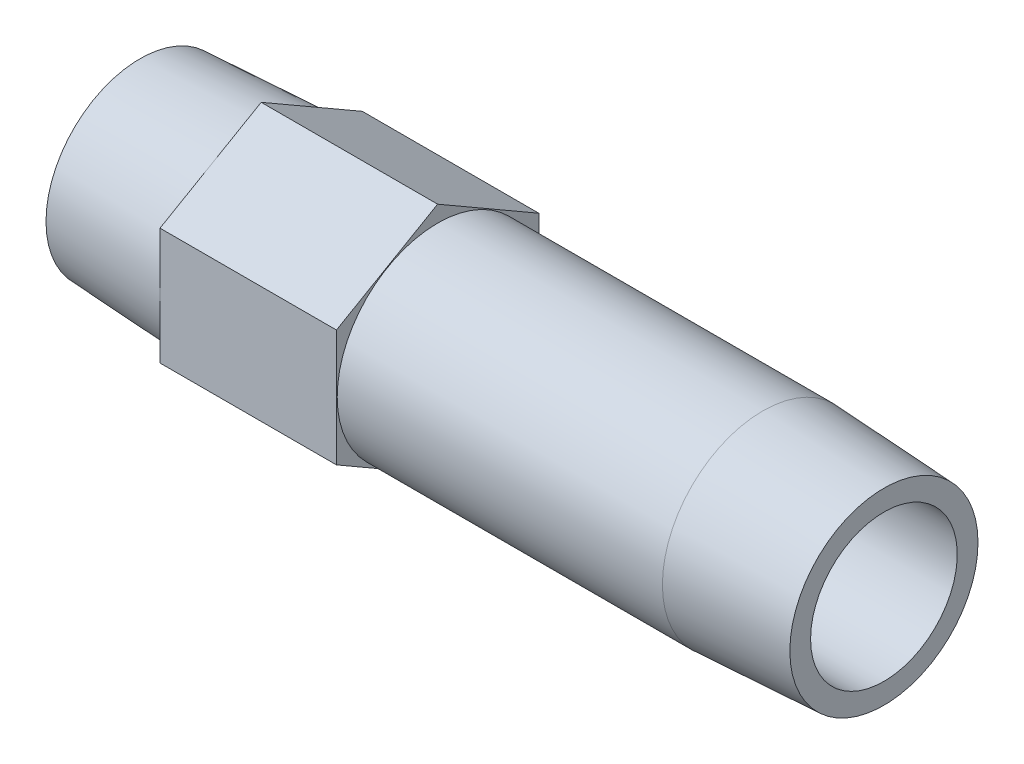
ISO-10303-21;
HEADER;
FILE_DESCRIPTION(('STEP AP214'),'2;1');
FILE_NAME('part.step','',(''),(''),'','','');
FILE_SCHEMA(('AUTOMOTIVE_DESIGN { 1 0 10303 214 1 1 1 1 }'));
ENDSEC;
DATA;
#1=APPLICATION_CONTEXT('core data for automotive mechanical design processes');
#2=APPLICATION_PROTOCOL_DEFINITION('international standard','automotive_design',2000,#1);
#3=PRODUCT_CONTEXT('',#1,'mechanical');
#4=PRODUCT('Part','Part','',(#3));
#5=PRODUCT_RELATED_PRODUCT_CATEGORY('part','',(#4));
#6=PRODUCT_DEFINITION_FORMATION('','',#4);
#7=PRODUCT_DEFINITION_CONTEXT('part definition',#1,'design');
#8=PRODUCT_DEFINITION('design','',#6,#7);
#9=PRODUCT_DEFINITION_SHAPE('','',#8);
#10=(LENGTH_UNIT() NAMED_UNIT(*) SI_UNIT(.MILLI.,.METRE.));
#11=(NAMED_UNIT(*) PLANE_ANGLE_UNIT() SI_UNIT($,.RADIAN.));
#12=(NAMED_UNIT(*) SI_UNIT($,.STERADIAN.) SOLID_ANGLE_UNIT());
#13=UNCERTAINTY_MEASURE_WITH_UNIT(LENGTH_MEASURE(1.E-05),#10,'distance_accuracy_value','');
#14=(GEOMETRIC_REPRESENTATION_CONTEXT(3) GLOBAL_UNCERTAINTY_ASSIGNED_CONTEXT((#13)) GLOBAL_UNIT_ASSIGNED_CONTEXT((#10,
#11,#12)) REPRESENTATION_CONTEXT('',''));
#15=CARTESIAN_POINT('',(0.,0.,0.));
#16=DIRECTION('',(0.,0.,1.));
#17=DIRECTION('',(1.,0.,0.));
#18=AXIS2_PLACEMENT_3D('',#15,#16,#17);
#19=CARTESIAN_POINT('',(0.,0.,-8.03071885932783));
#20=DIRECTION('',(1.,0.,0.));
#21=DIRECTION('',(0.,0.,-1.));
#22=AXIS2_PLACEMENT_3D('',#19,#20,#21);
#23=PLANE('',#22);
#24=CARTESIAN_POINT('',(0.,0.,0.));
#25=DIRECTION('',(-1.,0.,0.));
#26=DIRECTION('',(0.,0.,1.));
#27=AXIS2_PLACEMENT_3D('',#24,#25,#26);
#28=CIRCLE('',#27,8.03071885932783);
#29=CARTESIAN_POINT('',(0.,0.,8.03071885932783));
#30=VERTEX_POINT('',#29);
#31=EDGE_CURVE('E147',#30,#30,#28,.T.);
#32=ORIENTED_EDGE('',*,*,#31,.T.);
#33=EDGE_LOOP('',(#32));
#34=FACE_BOUND('',#33,.T.);
#35=CARTESIAN_POINT('',(0.,0.,0.));
#36=DIRECTION('',(1.,0.,0.));
#37=DIRECTION('',(0.,0.,1.));
#38=AXIS2_PLACEMENT_3D('',#35,#36,#37);
#39=CIRCLE('',#38,6.2611);
#40=CARTESIAN_POINT('',(0.,0.,6.2611));
#41=VERTEX_POINT('',#40);
#42=EDGE_CURVE('E159',#41,#41,#39,.T.);
#43=ORIENTED_EDGE('',*,*,#42,.T.);
#44=EDGE_LOOP('',(#43));
#45=FACE_BOUND('',#44,.T.);
#46=ADVANCED_FACE('F15',(#34,#45),#23,.F.);
#47=CARTESIAN_POINT('',(63.5,0.,-8.0307188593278));
#48=DIRECTION('',(-1.,0.,0.));
#49=DIRECTION('',(0.,0.,1.));
#50=AXIS2_PLACEMENT_3D('',#47,#48,#49);
#51=PLANE('',#50);
#52=CARTESIAN_POINT('',(63.5,0.,0.));
#53=DIRECTION('',(-1.,0.,0.));
#54=DIRECTION('',(0.,0.,1.));
#55=AXIS2_PLACEMENT_3D('',#52,#53,#54);
#56=CIRCLE('',#55,8.0307188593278);
#57=CARTESIAN_POINT('',(63.5,0.,8.0307188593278));
#58=VERTEX_POINT('',#57);
#59=EDGE_CURVE('E150',#58,#58,#56,.T.);
#60=ORIENTED_EDGE('',*,*,#59,.F.);
#61=EDGE_LOOP('',(#60));
#62=FACE_BOUND('',#61,.T.);
#63=CARTESIAN_POINT('',(63.5,0.,0.));
#64=DIRECTION('',(-1.,0.,0.));
#65=DIRECTION('',(0.,0.,1.));
#66=AXIS2_PLACEMENT_3D('',#63,#64,#65);
#67=CIRCLE('',#66,6.2611);
#68=CARTESIAN_POINT('',(63.5,0.,6.2611));
#69=VERTEX_POINT('',#68);
#70=EDGE_CURVE('E156',#69,#69,#67,.F.);
#71=ORIENTED_EDGE('',*,*,#70,.F.);
#72=EDGE_LOOP('',(#71));
#73=FACE_BOUND('',#72,.T.);
#74=ADVANCED_FACE('F178',(#62,#73),#51,.F.);
#75=CARTESIAN_POINT('',(25.4,-4.9859969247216,-8.636));
#76=DIRECTION('',(1.,0.,0.));
#77=DIRECTION('',(0.,1.,0.));
#78=AXIS2_PLACEMENT_3D('',#75,#76,#77);
#79=PLANE('',#78);
#80=DIRECTION('',(0.,0.5,-0.866025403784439));
#81=VECTOR('',#80,1.);
#82=CARTESIAN_POINT('',(25.4,-9.97199384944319,0.));
#83=LINE('',#82,#81);
#84=CARTESIAN_POINT('',(25.4,-9.97199384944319,0.));
#85=VERTEX_POINT('',#84);
#86=CARTESIAN_POINT('',(25.4,-4.9859969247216,-8.636));
#87=VERTEX_POINT('',#86);
#88=EDGE_CURVE('E103',#85,#87,#83,.T.);
#89=ORIENTED_EDGE('',*,*,#88,.T.);
#90=DIRECTION('',(0.,1.,0.));
#91=VECTOR('',#90,1.);
#92=CARTESIAN_POINT('',(25.4,-4.9859969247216,-8.636));
#93=LINE('',#92,#91);
#94=CARTESIAN_POINT('',(25.4,4.9859969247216,-8.636));
#95=VERTEX_POINT('',#94);
#96=EDGE_CURVE('E83',#87,#95,#93,.T.);
#97=ORIENTED_EDGE('',*,*,#96,.T.);
#98=DIRECTION('',(0.,0.5,0.866025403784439));
#99=VECTOR('',#98,1.);
#100=CARTESIAN_POINT('',(25.4,4.9859969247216,-8.636));
#101=LINE('',#100,#99);
#102=CARTESIAN_POINT('',(25.4,9.97199384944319,0.));
#103=VERTEX_POINT('',#102);
#104=EDGE_CURVE('E102',#95,#103,#101,.T.);
#105=ORIENTED_EDGE('',*,*,#104,.T.);
#106=DIRECTION('',(0.,-0.5,0.866025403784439));
#107=VECTOR('',#106,1.);
#108=CARTESIAN_POINT('',(25.4,9.97199384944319,0.));
#109=LINE('',#108,#107);
#110=CARTESIAN_POINT('',(25.4,4.9859969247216,8.636));
#111=VERTEX_POINT('',#110);
#112=EDGE_CURVE('E105',#103,#111,#109,.T.);
#113=ORIENTED_EDGE('',*,*,#112,.T.);
#114=DIRECTION('',(0.,-1.,0.));
#115=VECTOR('',#114,1.);
#116=CARTESIAN_POINT('',(25.4,4.9859969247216,8.636));
#117=LINE('',#116,#115);
#118=CARTESIAN_POINT('',(25.4,-4.9859969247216,8.636));
#119=VERTEX_POINT('',#118);
#120=EDGE_CURVE('E35',#111,#119,#117,.T.);
#121=ORIENTED_EDGE('',*,*,#120,.T.);
#122=DIRECTION('',(0.,-0.5,-0.866025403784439));
#123=VECTOR('',#122,1.);
#124=CARTESIAN_POINT('',(25.4,-4.9859969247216,8.636));
#125=LINE('',#124,#123);
#126=EDGE_CURVE('E30',#119,#85,#125,.T.);
#127=ORIENTED_EDGE('',*,*,#126,.T.);
#128=EDGE_LOOP('',(#89,#97,#105,#113,#121,#127));
#129=FACE_BOUND('',#128,.T.);
#130=CARTESIAN_POINT('',(25.4,0.,0.));
#131=DIRECTION('',(1.,0.,0.));
#132=DIRECTION('',(0.,1.,0.));
#133=AXIS2_PLACEMENT_3D('',#130,#131,#132);
#134=CIRCLE('',#133,8.5725);
#135=CARTESIAN_POINT('',(25.4,8.5725,0.));
#136=VERTEX_POINT('',#135);
#137=EDGE_CURVE('E89',#136,#136,#134,.F.);
#138=ORIENTED_EDGE('',*,*,#137,.T.);
#139=EDGE_LOOP('',(#138));
#140=FACE_BOUND('',#139,.T.);
#141=ADVANCED_FACE('F124',(#129,#140),#79,.T.);
#142=CARTESIAN_POINT('',(10.3378,-4.9859969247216,-8.636));
#143=DIRECTION('',(1.,0.,0.));
#144=DIRECTION('',(0.,1.,0.));
#145=AXIS2_PLACEMENT_3D('',#142,#143,#144);
#146=PLANE('',#145);
#147=DIRECTION('',(0.,0.5,-0.866025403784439));
#148=VECTOR('',#147,1.);
#149=CARTESIAN_POINT('',(10.3378,-9.97199384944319,0.));
#150=LINE('',#149,#148);
#151=CARTESIAN_POINT('',(10.3378,-9.97199384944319,0.));
#152=VERTEX_POINT('',#151);
#153=CARTESIAN_POINT('',(10.3378,-4.9859969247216,-8.636));
#154=VERTEX_POINT('',#153);
#155=EDGE_CURVE('E73',#152,#154,#150,.T.);
#156=ORIENTED_EDGE('',*,*,#155,.F.);
#157=DIRECTION('',(0.,-0.5,-0.866025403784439));
#158=VECTOR('',#157,1.);
#159=CARTESIAN_POINT('',(10.3378,-4.9859969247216,8.636));
#160=LINE('',#159,#158);
#161=CARTESIAN_POINT('',(10.3378,-4.9859969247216,8.636));
#162=VERTEX_POINT('',#161);
#163=EDGE_CURVE('E99',#162,#152,#160,.T.);
#164=ORIENTED_EDGE('',*,*,#163,.F.);
#165=DIRECTION('',(0.,-1.,0.));
#166=VECTOR('',#165,1.);
#167=CARTESIAN_POINT('',(10.3378,4.9859969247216,8.636));
#168=LINE('',#167,#166);
#169=CARTESIAN_POINT('',(10.3378,4.9859969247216,8.636));
#170=VERTEX_POINT('',#169);
#171=EDGE_CURVE('E133',#170,#162,#168,.T.);
#172=ORIENTED_EDGE('',*,*,#171,.F.);
#173=DIRECTION('',(0.,-0.5,0.866025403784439));
#174=VECTOR('',#173,1.);
#175=CARTESIAN_POINT('',(10.3378,9.97199384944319,0.));
#176=LINE('',#175,#174);
#177=CARTESIAN_POINT('',(10.3378,9.97199384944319,0.));
#178=VERTEX_POINT('',#177);
#179=EDGE_CURVE('E129',#178,#170,#176,.T.);
#180=ORIENTED_EDGE('',*,*,#179,.F.);
#181=DIRECTION('',(0.,0.5,0.866025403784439));
#182=VECTOR('',#181,1.);
#183=CARTESIAN_POINT('',(10.3378,4.9859969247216,-8.636));
#184=LINE('',#183,#182);
#185=CARTESIAN_POINT('',(10.3378,4.9859969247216,-8.636));
#186=VERTEX_POINT('',#185);
#187=EDGE_CURVE('E75',#186,#178,#184,.T.);
#188=ORIENTED_EDGE('',*,*,#187,.F.);
#189=DIRECTION('',(0.,1.,0.));
#190=VECTOR('',#189,1.);
#191=CARTESIAN_POINT('',(10.3378,-4.9859969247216,-8.636));
#192=LINE('',#191,#190);
#193=EDGE_CURVE('E68',#154,#186,#192,.T.);
#194=ORIENTED_EDGE('',*,*,#193,.F.);
#195=EDGE_LOOP('',(#156,#164,#172,#180,#188,#194));
#196=FACE_BOUND('',#195,.T.);
#197=CARTESIAN_POINT('',(10.3378,0.,0.));
#198=DIRECTION('',(-1.,0.,0.));
#199=DIRECTION('',(0.,0.,1.));
#200=AXIS2_PLACEMENT_3D('',#197,#198,#199);
#201=CIRCLE('',#200,8.5725);
#202=CARTESIAN_POINT('',(10.3378,0.,8.5725));
#203=VERTEX_POINT('',#202);
#204=EDGE_CURVE('E95',#203,#203,#201,.T.);
#205=ORIENTED_EDGE('',*,*,#204,.F.);
#206=EDGE_LOOP('',(#205));
#207=FACE_BOUND('',#206,.T.);
#208=ADVANCED_FACE('F69',(#196,#207),#146,.F.);
#209=CARTESIAN_POINT('',(25.4,-9.97199384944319,0.));
#210=DIRECTION('',(0.,0.866025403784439,0.5));
#211=DIRECTION('',(0.,-0.5,0.866025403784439));
#212=AXIS2_PLACEMENT_3D('',#209,#210,#211);
#213=PLANE('',#212);
#214=ORIENTED_EDGE('',*,*,#155,.T.);
#215=DIRECTION('',(-1.,0.,0.));
#216=VECTOR('',#215,1.);
#217=CARTESIAN_POINT('',(25.4,-4.9859969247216,-8.636));
#218=LINE('',#217,#216);
#219=EDGE_CURVE('E10',#87,#154,#218,.T.);
#220=ORIENTED_EDGE('',*,*,#219,.F.);
#221=ORIENTED_EDGE('',*,*,#88,.F.);
#222=DIRECTION('',(-1.,0.,0.));
#223=VECTOR('',#222,1.);
#224=CARTESIAN_POINT('',(25.4,-9.97199384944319,0.));
#225=LINE('',#224,#223);
#226=EDGE_CURVE('E87',#85,#152,#225,.T.);
#227=ORIENTED_EDGE('',*,*,#226,.T.);
#228=EDGE_LOOP('',(#214,#220,#221,#227));
#229=FACE_BOUND('',#228,.T.);
#230=ADVANCED_FACE('F17',(#229),#213,.F.);
#231=CARTESIAN_POINT('',(25.4,-4.9859969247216,-8.636));
#232=DIRECTION('',(0.,0.,1.));
#233=DIRECTION('',(1.,0.,0.));
#234=AXIS2_PLACEMENT_3D('',#231,#232,#233);
#235=PLANE('',#234);
#236=ORIENTED_EDGE('',*,*,#193,.T.);
#237=DIRECTION('',(-1.,0.,0.));
#238=VECTOR('',#237,1.);
#239=CARTESIAN_POINT('',(25.4,4.9859969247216,-8.636));
#240=LINE('',#239,#238);
#241=EDGE_CURVE('E23',#95,#186,#240,.T.);
#242=ORIENTED_EDGE('',*,*,#241,.F.);
#243=ORIENTED_EDGE('',*,*,#96,.F.);
#244=ORIENTED_EDGE('',*,*,#219,.T.);
#245=EDGE_LOOP('',(#236,#242,#243,#244));
#246=FACE_BOUND('',#245,.T.);
#247=ADVANCED_FACE('F82',(#246),#235,.F.);
#248=CARTESIAN_POINT('',(25.4,4.9859969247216,-8.636));
#249=DIRECTION('',(0.,-0.866025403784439,0.5));
#250=DIRECTION('',(0.,-0.5,-0.866025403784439));
#251=AXIS2_PLACEMENT_3D('',#248,#249,#250);
#252=PLANE('',#251);
#253=ORIENTED_EDGE('',*,*,#187,.T.);
#254=DIRECTION('',(-1.,0.,0.));
#255=VECTOR('',#254,1.);
#256=CARTESIAN_POINT('',(25.4,9.97199384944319,0.));
#257=LINE('',#256,#255);
#258=EDGE_CURVE('E117',#103,#178,#257,.T.);
#259=ORIENTED_EDGE('',*,*,#258,.F.);
#260=ORIENTED_EDGE('',*,*,#104,.F.);
#261=ORIENTED_EDGE('',*,*,#241,.T.);
#262=EDGE_LOOP('',(#253,#259,#260,#261));
#263=FACE_BOUND('',#262,.T.);
#264=ADVANCED_FACE('F121',(#263),#252,.F.);
#265=CARTESIAN_POINT('',(25.4,9.97199384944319,0.));
#266=DIRECTION('',(0.,-0.866025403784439,-0.5));
#267=DIRECTION('',(0.,0.5,-0.866025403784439));
#268=AXIS2_PLACEMENT_3D('',#265,#266,#267);
#269=PLANE('',#268);
#270=ORIENTED_EDGE('',*,*,#179,.T.);
#271=DIRECTION('',(-1.,0.,0.));
#272=VECTOR('',#271,1.);
#273=CARTESIAN_POINT('',(25.4,4.9859969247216,8.636));
#274=LINE('',#273,#272);
#275=EDGE_CURVE('E114',#111,#170,#274,.T.);
#276=ORIENTED_EDGE('',*,*,#275,.F.);
#277=ORIENTED_EDGE('',*,*,#112,.F.);
#278=ORIENTED_EDGE('',*,*,#258,.T.);
#279=EDGE_LOOP('',(#270,#276,#277,#278));
#280=FACE_BOUND('',#279,.T.);
#281=ADVANCED_FACE('F128',(#280),#269,.F.);
#282=CARTESIAN_POINT('',(25.4,4.9859969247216,8.636));
#283=DIRECTION('',(0.,0.,-1.));
#284=DIRECTION('',(-1.,0.,0.));
#285=AXIS2_PLACEMENT_3D('',#282,#283,#284);
#286=PLANE('',#285);
#287=ORIENTED_EDGE('',*,*,#171,.T.);
#288=DIRECTION('',(-1.,0.,0.));
#289=VECTOR('',#288,1.);
#290=CARTESIAN_POINT('',(25.4,-4.9859969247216,8.636));
#291=LINE('',#290,#289);
#292=EDGE_CURVE('E111',#119,#162,#291,.T.);
#293=ORIENTED_EDGE('',*,*,#292,.F.);
#294=ORIENTED_EDGE('',*,*,#120,.F.);
#295=ORIENTED_EDGE('',*,*,#275,.T.);
#296=EDGE_LOOP('',(#287,#293,#294,#295));
#297=FACE_BOUND('',#296,.T.);
#298=ADVANCED_FACE('F132',(#297),#286,.F.);
#299=CARTESIAN_POINT('',(25.4,-4.9859969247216,8.636));
#300=DIRECTION('',(0.,0.866025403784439,-0.5));
#301=DIRECTION('',(0.,0.5,0.866025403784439));
#302=AXIS2_PLACEMENT_3D('',#299,#300,#301);
#303=PLANE('',#302);
#304=ORIENTED_EDGE('',*,*,#163,.T.);
#305=ORIENTED_EDGE('',*,*,#226,.F.);
#306=ORIENTED_EDGE('',*,*,#126,.F.);
#307=ORIENTED_EDGE('',*,*,#292,.T.);
#308=EDGE_LOOP('',(#304,#305,#306,#307));
#309=FACE_BOUND('',#308,.T.);
#310=ADVANCED_FACE('F135',(#309),#303,.F.);
#311=CARTESIAN_POINT('',(10.3378,0.,0.));
#312=DIRECTION('',(1.,0.,0.));
#313=DIRECTION('',(0.,0.,-1.));
#314=AXIS2_PLACEMENT_3D('',#311,#312,#313);
#315=CONICAL_SURFACE('',#314,8.5725,0.0523598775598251);
#316=ORIENTED_EDGE('',*,*,#31,.F.);
#317=EDGE_LOOP('',(#316));
#318=FACE_BOUND('',#317,.T.);
#319=ORIENTED_EDGE('',*,*,#204,.T.);
#320=EDGE_LOOP('',(#319));
#321=FACE_BOUND('',#320,.T.);
#322=ADVANCED_FACE('F187',(#318,#321),#315,.T.);
#323=CARTESIAN_POINT('',(-60.,0.,0.));
#324=DIRECTION('',(-1.,0.,0.));
#325=DIRECTION('',(0.,0.,1.));
#326=AXIS2_PLACEMENT_3D('',#323,#324,#325);
#327=CYLINDRICAL_SURFACE('',#326,8.5725);
#328=ORIENTED_EDGE('',*,*,#137,.F.);
#329=EDGE_LOOP('',(#328));
#330=FACE_BOUND('',#329,.T.);
#331=CARTESIAN_POINT('',(53.1622,0.,0.));
#332=DIRECTION('',(-1.,0.,0.));
#333=DIRECTION('',(0.,0.,1.));
#334=AXIS2_PLACEMENT_3D('',#331,#332,#333);
#335=CIRCLE('',#334,8.5725);
#336=CARTESIAN_POINT('',(53.1622,0.,8.5725));
#337=VERTEX_POINT('',#336);
#338=EDGE_CURVE('E153',#337,#337,#335,.T.);
#339=ORIENTED_EDGE('',*,*,#338,.T.);
#340=EDGE_LOOP('',(#339));
#341=FACE_BOUND('',#340,.T.);
#342=ADVANCED_FACE('F174',(#330,#341),#327,.T.);
#343=CARTESIAN_POINT('',(63.5,0.,0.));
#344=DIRECTION('',(-1.,0.,0.));
#345=DIRECTION('',(0.,0.,1.));
#346=AXIS2_PLACEMENT_3D('',#343,#344,#345);
#347=CONICAL_SURFACE('',#346,8.0307188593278,0.0523598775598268);
#348=ORIENTED_EDGE('',*,*,#338,.F.);
#349=EDGE_LOOP('',(#348));
#350=FACE_BOUND('',#349,.T.);
#351=ORIENTED_EDGE('',*,*,#59,.T.);
#352=EDGE_LOOP('',(#351));
#353=FACE_BOUND('',#352,.T.);
#354=ADVANCED_FACE('F167',(#350,#353),#347,.T.);
#355=CARTESIAN_POINT('',(68.7628870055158,0.,0.));
#356=DIRECTION('',(-1.,0.,0.));
#357=DIRECTION('',(0.,0.,1.));
#358=AXIS2_PLACEMENT_3D('',#355,#356,#357);
#359=CYLINDRICAL_SURFACE('',#358,6.2611);
#360=ORIENTED_EDGE('',*,*,#70,.T.);
#361=EDGE_LOOP('',(#360));
#362=FACE_BOUND('',#361,.T.);
#363=ORIENTED_EDGE('',*,*,#42,.F.);
#364=EDGE_LOOP('',(#363));
#365=FACE_BOUND('',#364,.T.);
#366=ADVANCED_FACE('F165',(#362,#365),#359,.F.);
#367=CLOSED_SHELL('',(#46,#74,#141,#208,#230,#247,#264,#281,#298,#310,#322,#342,#354,#366));
#368=MANIFOLD_SOLID_BREP('B1',#367);
#369=ADVANCED_BREP_SHAPE_REPRESENTATION('',(#18,#368),#14);
#370=SHAPE_DEFINITION_REPRESENTATION(#9,#369);
ENDSEC;
END-ISO-10303-21;
